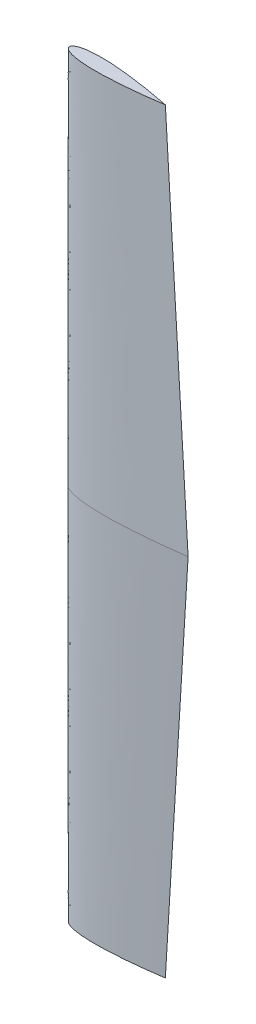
from build123d import *


with BuildPart() as part:
    # rootSketch → Loft1 section 0
    with BuildSketch(Plane(origin=(0, 0, 0), x_dir=(1, 0, 0), z_dir=(0, 1, 0))):
        with BuildLine():
            add(Edge.make_bspline(
                [(0, 0), (-0.000243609, 0.566727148), (0.053918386, 1.483720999), (0.261917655, 2.801146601), (0.780245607, 4.5001283), (1.474202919, 6.073917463), (2.488203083, 7.777515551), (3.923488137, 9.638272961), (5.98143448, 11.733456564), (9.009039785, 14.163971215), (13.617387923, 17.052233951), (20.657602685, 20.415173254), (31.574426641, 24.257311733), (47.946980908, 28.244273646), (72.433246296, 31.956656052), (104.069773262, 34.152129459), (136.009752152, 34.338072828), (166.234970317, 33.283873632), (196.419325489, 31.454038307), (226.557407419, 28.95723658), (256.632461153, 25.794097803), (286.64680564, 22.111933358), (311.62022345, 18.747606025), (329.081671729, 16.251015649), (344.035486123, 14.017658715), (356.48688725, 12.097258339), (366.444546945, 10.525821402), (376.392835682, 8.921241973), (386.342365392, 7.281828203), (398.760355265, 5.193915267), (413.671231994, 2.618476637), (431.015985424, -0.473946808), (450.869928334, -4.152657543), (468.142470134, -7.474474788), (483.047212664, -10.43662524), (495.267849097, -12.926812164), (504.146113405, -14.775349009), (511.094944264, -16.242674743), (516.643134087, -17.43351124), (518.880204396, -17.916243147), (520.000000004, -18.158800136)],
                knots=[0, 0, 0, 0, 0, 0.003843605, 0.006239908, 0.009022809, 0.012042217, 0.015499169, 0.019677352, 0.024950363, 0.031948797, 0.041817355, 0.056547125, 0.07784963, 0.110439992, 0.156133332, 0.224610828, 0.293088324, 0.327327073, 0.361565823, 0.430043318, 0.498520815, 0.532759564, 0.566998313, 0.601237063, 0.618356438, 0.635475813, 0.652595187, 0.669714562, 0.686833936, 0.703953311, 0.738192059, 0.772430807, 0.806669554, 0.840908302, 0.858027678, 0.875147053, 0.892266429, 0.900826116, 0.909385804, 0.909385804, 0.909385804, 0.909385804, 0.909385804], degree=4))
            add(Edge.make_bspline(
                [(0, 0), (-0.039775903, -0.565329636), (-0.049712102, -1.483867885), (0.065881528, -2.812593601), (0.464431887, -4.543593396), (1.046916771, -6.161956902), (1.939609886, -7.932138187), (3.241598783, -9.888483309), (5.148379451, -12.12211823), (7.99906553, -14.757907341), (12.39471294, -17.960596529), (19.183191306, -21.806444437), (29.805408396, -26.400742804), (45.859963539, -31.520084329), (70.02761891, -36.931499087), (101.433932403, -41.328476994), (133.283136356, -43.741987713), (163.508264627, -44.798761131), (193.746735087, -45.078937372), (223.985570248, -44.690544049), (254.20801207, -43.633040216), (284.40609793, -42.053540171), (309.553365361, -40.439465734), (327.146431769, -39.167005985), (342.219610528, -37.982214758), (354.774641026, -36.935058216), (364.817662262, -36.062060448), (374.85364727, -35.155347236), (384.89330015, -34.213971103), (397.426685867, -32.997379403), (412.480893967, -31.468344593), (429.999113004, -29.593362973), (450.061306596, -27.30855444), (467.52349161, -25.199700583), (482.598556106, -23.284468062), (494.963130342, -21.652815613), (503.948715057, -20.428098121), (510.982974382, -19.449072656), (516.600717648, -18.648159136), (518.866012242, -18.322653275), (520.000000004, -18.158800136)],
                knots=[0, 0, 0, 0, 0, 0.003843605, 0.006239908, 0.009022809, 0.012042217, 0.015499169, 0.019677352, 0.024950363, 0.031948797, 0.041817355, 0.056547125, 0.07784963, 0.110439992, 0.156133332, 0.224610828, 0.293088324, 0.327327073, 0.361565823, 0.430043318, 0.498520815, 0.532759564, 0.566998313, 0.601237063, 0.618356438, 0.635475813, 0.652595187, 0.669714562, 0.686833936, 0.703953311, 0.738192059, 0.772430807, 0.806669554, 0.840908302, 0.858027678, 0.875147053, 0.892266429, 0.900826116, 0.909385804, 0.909385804, 0.909385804, 0.909385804, 0.909385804], degree=4))
        make_face()
    # tipSketch → Loft1 section 1
    with BuildSketch(Plane(origin=(0, 1599.9984, 0), x_dir=(1, 0, 0), z_dir=(0, 1, 0))):
        with BuildLine():
            add(Edge.make_bspline(
                [(0, 0), (-0.000216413, 0.453684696), (0.043156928, 1.187262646), (0.209215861, 2.240269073), (0.621975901, 3.599694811), (1.173783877, 4.859061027), (1.979043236, 6.223952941), (3.118973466, 7.717898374), (4.753331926, 9.40414094), (7.158934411, 11.366652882), (10.823326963, 13.708854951), (16.426868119, 16.452052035), (25.125057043, 19.612204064), (38.183776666, 22.935471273), (57.732502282, 26.107498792), (83.011249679, 28.125549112), (112.5812498, 28.600369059), (140.784714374, 27.673071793), (164.919840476, 26.167403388), (185.003872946, 24.52480859), (201.052900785, 23.008716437), (217.084066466, 21.313556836), (233.097620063, 19.459783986), (249.093741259, 17.463027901), (265.073497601, 15.336224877), (279.040604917, 13.370198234), (291.003455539, 11.614235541), (300.963710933, 10.105767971), (308.931132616, 8.871452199), (318.878055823, 7.296848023), (330.818855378, 5.351946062), (344.714802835, 3.010893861), (360.613589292, 0.221346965), (374.457565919, -2.305395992), (386.386967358, -4.559035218), (396.195850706, -6.461878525), (403.274906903, -7.86617671), (408.898018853, -8.998809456), (413.29259013, -9.898934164), (415.102636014, -10.271824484), (416, -10.45742227)],
                knots=[0, 0, 0, 0, 0, 0.003845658, 0.006245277, 0.009022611, 0.012044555, 0.015501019, 0.019679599, 0.024953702, 0.03195376, 0.041823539, 0.056555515, 0.077861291, 0.110456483, 0.156156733, 0.224644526, 0.293132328, 0.361620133, 0.395864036, 0.43010794, 0.464351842, 0.498595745, 0.532839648, 0.567083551, 0.601327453, 0.635571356, 0.652693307, 0.669815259, 0.68693721, 0.704059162, 0.738303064, 0.772546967, 0.806790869, 0.841034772, 0.858156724, 0.875278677, 0.892400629, 0.900961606, 0.909522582, 0.909522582, 0.909522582, 0.909522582, 0.909522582], degree=4))
            add(Edge.make_bspline(
                [(0, 0), (-0.023011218, -0.453100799), (-0.016550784, -1.187931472), (0.09639082, -2.247951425), (0.440326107, -3.626398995), (0.928161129, -4.911899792), (1.663825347, -6.315527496), (2.727253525, -7.864861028), (4.274823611, -9.631091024), (6.578782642, -11.711992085), (10.120864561, -14.235350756), (15.579498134, -17.256629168), (24.107921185, -20.849824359), (36.983171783, -24.825020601), (56.34783015, -28.975254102), (81.49325383, -32.260868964), (111.002048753, -34.220813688), (139.216482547, -34.711751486), (163.396776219, -34.420637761), (183.53797274, -33.789226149), (199.642904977, -33.081421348), (215.738994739, -32.193877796), (231.825464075, -31.147036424), (247.901707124, -29.956516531), (263.968140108, -28.635291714), (278.01638803, -27.373516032), (290.052356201, -26.220836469), (300.075823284, -25.214720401), (308.095199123, -24.382281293), (318.108673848, -23.309442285), (330.132111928, -21.966954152), (344.128132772, -20.327051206), (360.146997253, -18.339851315), (374.100442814, -16.51188091), (386.128009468, -14.86047277), (396.020110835, -13.452873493), (403.160783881, -12.406031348), (408.833701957, -11.557358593), (413.267948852, -10.87917302), (415.094444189, -10.597698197), (416, -10.45742227)],
                knots=[0, 0, 0, 0, 0, 0.003845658, 0.006245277, 0.009022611, 0.012044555, 0.015501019, 0.019679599, 0.024953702, 0.03195376, 0.041823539, 0.056555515, 0.077861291, 0.110456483, 0.156156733, 0.224644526, 0.293132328, 0.361620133, 0.395864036, 0.43010794, 0.464351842, 0.498595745, 0.532839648, 0.567083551, 0.601327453, 0.635571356, 0.652693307, 0.669815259, 0.68693721, 0.704059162, 0.738303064, 0.772546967, 0.806790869, 0.841034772, 0.858156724, 0.875278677, 0.892400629, 0.900961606, 0.909522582, 0.909522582, 0.909522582, 0.909522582, 0.909522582], degree=4))
        make_face()
    loft1 = loft()

    # Mirror1: Loft1 across plane
    add(loft1.mirror(Plane.ZX))


solid = part.part
